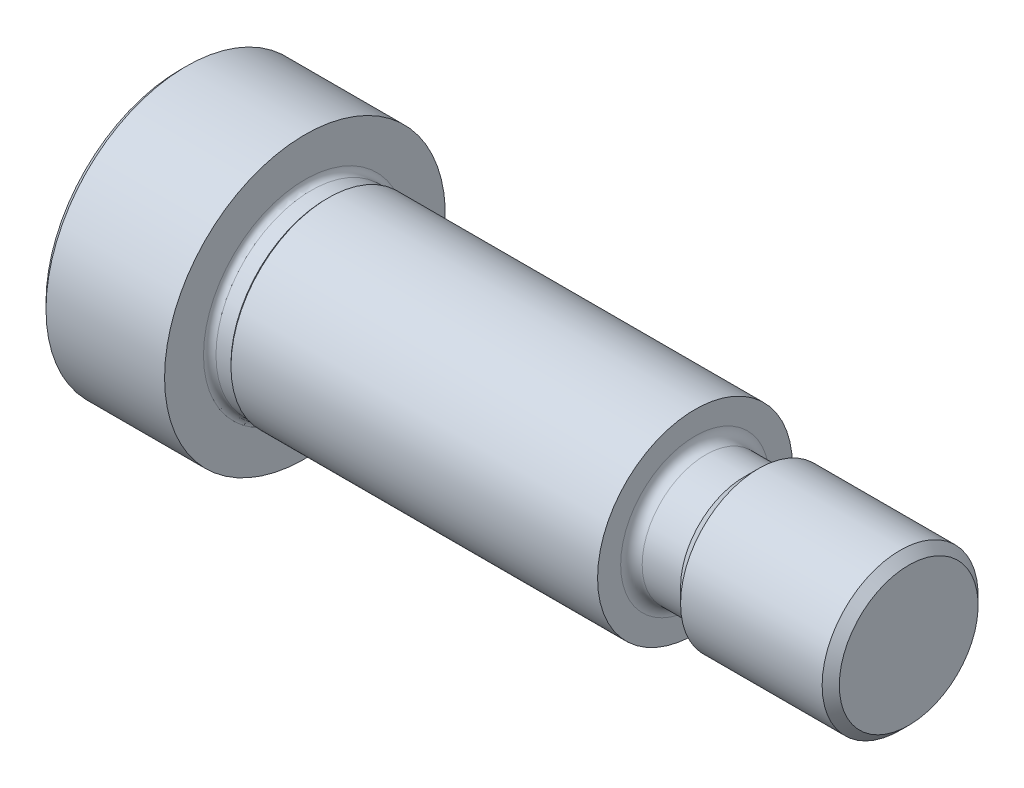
ISO-10303-21;
HEADER;
FILE_DESCRIPTION(('STEP AP214'),'2;1');
FILE_NAME('part.step','',(''),(''),'','','');
FILE_SCHEMA(('AUTOMOTIVE_DESIGN { 1 0 10303 214 1 1 1 1 }'));
ENDSEC;
DATA;
#1=APPLICATION_CONTEXT('core data for automotive mechanical design processes');
#2=APPLICATION_PROTOCOL_DEFINITION('international standard','automotive_design',2000,#1);
#3=PRODUCT_CONTEXT('',#1,'mechanical');
#4=PRODUCT('Part','Part','',(#3));
#5=PRODUCT_RELATED_PRODUCT_CATEGORY('part','',(#4));
#6=PRODUCT_DEFINITION_FORMATION('','',#4);
#7=PRODUCT_DEFINITION_CONTEXT('part definition',#1,'design');
#8=PRODUCT_DEFINITION('design','',#6,#7);
#9=PRODUCT_DEFINITION_SHAPE('','',#8);
#10=(LENGTH_UNIT() NAMED_UNIT(*) SI_UNIT(.MILLI.,.METRE.));
#11=(NAMED_UNIT(*) PLANE_ANGLE_UNIT() SI_UNIT($,.RADIAN.));
#12=(NAMED_UNIT(*) SI_UNIT($,.STERADIAN.) SOLID_ANGLE_UNIT());
#13=UNCERTAINTY_MEASURE_WITH_UNIT(LENGTH_MEASURE(1.E-05),#10,'distance_accuracy_value','');
#14=(GEOMETRIC_REPRESENTATION_CONTEXT(3) GLOBAL_UNCERTAINTY_ASSIGNED_CONTEXT((#13)) GLOBAL_UNIT_ASSIGNED_CONTEXT((#10,
#11,#12)) REPRESENTATION_CONTEXT('',''));
#15=CARTESIAN_POINT('',(0.,0.,0.));
#16=DIRECTION('',(0.,0.,1.));
#17=DIRECTION('',(1.,0.,0.));
#18=AXIS2_PLACEMENT_3D('',#15,#16,#17);
#19=CARTESIAN_POINT('',(0.,0.,0.));
#20=DIRECTION('',(-1.,0.,0.));
#21=DIRECTION('',(0.,0.,1.));
#22=AXIS2_PLACEMENT_3D('',#19,#20,#21);
#23=PLANE('',#22);
#24=CARTESIAN_POINT('',(0.,0.,0.));
#25=DIRECTION('',(-1.,0.,0.));
#26=DIRECTION('',(0.,0.,1.));
#27=AXIS2_PLACEMENT_3D('',#24,#25,#26);
#28=CIRCLE('',#27,17.2);
#29=CARTESIAN_POINT('',(0.,0.,17.2));
#30=VERTEX_POINT('',#29);
#31=EDGE_CURVE('E49',#30,#30,#28,.T.);
#32=ORIENTED_EDGE('',*,*,#31,.T.);
#33=EDGE_LOOP('',(#32));
#34=FACE_BOUND('',#33,.T.);
#35=DIRECTION('',(0.,-0.5,-0.866025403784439));
#36=VECTOR('',#35,1.);
#37=CARTESIAN_POINT('',(0.,-3.46410161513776,6.));
#38=LINE('',#37,#36);
#39=CARTESIAN_POINT('',(0.,-3.46410161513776,6.));
#40=VERTEX_POINT('',#39);
#41=CARTESIAN_POINT('',(0.,-6.92820323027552,0.));
#42=VERTEX_POINT('',#41);
#43=EDGE_CURVE('E56',#40,#42,#38,.T.);
#44=ORIENTED_EDGE('',*,*,#43,.T.);
#45=DIRECTION('',(0.,0.5,-0.866025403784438));
#46=VECTOR('',#45,1.);
#47=CARTESIAN_POINT('',(0.,-6.92820323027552,0.));
#48=LINE('',#47,#46);
#49=CARTESIAN_POINT('',(0.,-3.46410161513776,-6.));
#50=VERTEX_POINT('',#49);
#51=EDGE_CURVE('E331',#42,#50,#48,.T.);
#52=ORIENTED_EDGE('',*,*,#51,.T.);
#53=DIRECTION('',(0.,1.,0.));
#54=VECTOR('',#53,1.);
#55=CARTESIAN_POINT('',(0.,-3.46410161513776,-6.));
#56=LINE('',#55,#54);
#57=CARTESIAN_POINT('',(0.,3.46410161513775,-6.));
#58=VERTEX_POINT('',#57);
#59=EDGE_CURVE('E136',#50,#58,#56,.T.);
#60=ORIENTED_EDGE('',*,*,#59,.T.);
#61=DIRECTION('',(0.,0.500000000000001,0.866025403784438));
#62=VECTOR('',#61,1.);
#63=CARTESIAN_POINT('',(0.,3.46410161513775,-6.));
#64=LINE('',#63,#62);
#65=CARTESIAN_POINT('',(0.,6.92820323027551,0.));
#66=VERTEX_POINT('',#65);
#67=EDGE_CURVE('E334',#58,#66,#64,.T.);
#68=ORIENTED_EDGE('',*,*,#67,.T.);
#69=DIRECTION('',(0.,-0.500000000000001,0.866025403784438));
#70=VECTOR('',#69,1.);
#71=CARTESIAN_POINT('',(0.,6.92820323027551,0.));
#72=LINE('',#71,#70);
#73=CARTESIAN_POINT('',(0.,3.46410161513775,6.));
#74=VERTEX_POINT('',#73);
#75=EDGE_CURVE('E336',#66,#74,#72,.T.);
#76=ORIENTED_EDGE('',*,*,#75,.T.);
#77=DIRECTION('',(0.,-1.,0.));
#78=VECTOR('',#77,1.);
#79=CARTESIAN_POINT('',(0.,3.46410161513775,6.));
#80=LINE('',#79,#78);
#81=EDGE_CURVE('E338',#74,#40,#80,.T.);
#82=ORIENTED_EDGE('',*,*,#81,.T.);
#83=EDGE_LOOP('',(#44,#52,#60,#68,#76,#82));
#84=FACE_BOUND('',#83,.T.);
#85=ADVANCED_FACE('F41',(#34,#84),#23,.T.);
#86=CARTESIAN_POINT('',(-6.34999999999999,0.,0.));
#87=DIRECTION('',(-1.,0.,0.));
#88=DIRECTION('',(0.,0.,1.));
#89=AXIS2_PLACEMENT_3D('',#86,#87,#88);
#90=CYLINDRICAL_SURFACE('',#89,18.);
#91=CARTESIAN_POINT('',(0.800000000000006,0.,0.));
#92=DIRECTION('',(-1.,0.,0.));
#93=DIRECTION('',(0.,0.,1.));
#94=AXIS2_PLACEMENT_3D('',#91,#92,#93);
#95=CIRCLE('',#94,18.);
#96=CARTESIAN_POINT('',(0.800000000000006,0.,18.));
#97=VERTEX_POINT('',#96);
#98=EDGE_CURVE('E11',#97,#97,#95,.F.);
#99=ORIENTED_EDGE('',*,*,#98,.T.);
#100=EDGE_LOOP('',(#99));
#101=FACE_BOUND('',#100,.T.);
#102=CARTESIAN_POINT('',(16.,0.,0.));
#103=DIRECTION('',(-1.,0.,0.));
#104=DIRECTION('',(0.,0.,1.));
#105=AXIS2_PLACEMENT_3D('',#102,#103,#104);
#106=CIRCLE('',#105,18.);
#107=CARTESIAN_POINT('',(16.,0.,18.));
#108=VERTEX_POINT('',#107);
#109=EDGE_CURVE('E183',#108,#108,#106,.T.);
#110=ORIENTED_EDGE('',*,*,#109,.T.);
#111=EDGE_LOOP('',(#110));
#112=FACE_BOUND('',#111,.T.);
#113=ADVANCED_FACE('F203',(#101,#112),#90,.T.);
#114=CARTESIAN_POINT('',(16.,18.,0.));
#115=DIRECTION('',(1.,0.,0.));
#116=DIRECTION('',(0.,0.,-1.));
#117=AXIS2_PLACEMENT_3D('',#114,#115,#116);
#118=PLANE('',#117);
#119=CARTESIAN_POINT('',(16.,0.,0.));
#120=DIRECTION('',(-1.,0.,0.));
#121=DIRECTION('',(0.,0.,1.));
#122=AXIS2_PLACEMENT_3D('',#119,#120,#121);
#123=CIRCLE('',#122,13.01);
#124=CARTESIAN_POINT('',(16.,0.,13.01));
#125=VERTEX_POINT('',#124);
#126=EDGE_CURVE('E180',#125,#125,#123,.T.);
#127=ORIENTED_EDGE('',*,*,#126,.T.);
#128=EDGE_LOOP('',(#127));
#129=FACE_BOUND('',#128,.T.);
#130=ORIENTED_EDGE('',*,*,#109,.F.);
#131=EDGE_LOOP('',(#130));
#132=FACE_BOUND('',#131,.T.);
#133=ADVANCED_FACE('F206',(#129,#132),#118,.T.);
#134=CARTESIAN_POINT('',(16.8,0.,0.));
#135=DIRECTION('',(-1.,0.,0.));
#136=DIRECTION('',(0.,0.,1.));
#137=AXIS2_PLACEMENT_3D('',#134,#135,#136);
#138=TOROIDAL_SURFACE('',#137,13.01,0.800000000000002);
#139=ORIENTED_EDGE('',*,*,#126,.F.);
#140=EDGE_LOOP('',(#139));
#141=FACE_BOUND('',#140,.T.);
#142=CARTESIAN_POINT('',(16.8,0.,0.));
#143=DIRECTION('',(-1.,0.,0.));
#144=DIRECTION('',(0.,0.,1.));
#145=AXIS2_PLACEMENT_3D('',#142,#143,#144);
#146=CIRCLE('',#145,12.21);
#147=CARTESIAN_POINT('',(16.8,0.,12.21));
#148=VERTEX_POINT('',#147);
#149=EDGE_CURVE('E177',#148,#148,#146,.T.);
#150=ORIENTED_EDGE('',*,*,#149,.T.);
#151=EDGE_LOOP('',(#150));
#152=FACE_BOUND('',#151,.T.);
#153=ADVANCED_FACE('F212',(#141,#152),#138,.F.);
#154=CARTESIAN_POINT('',(-6.34999999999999,0.,0.));
#155=DIRECTION('',(-1.,0.,0.));
#156=DIRECTION('',(0.,0.,1.));
#157=AXIS2_PLACEMENT_3D('',#154,#155,#156);
#158=CYLINDRICAL_SURFACE('',#157,12.21);
#159=CARTESIAN_POINT('',(18.72,0.,0.));
#160=DIRECTION('',(-1.,0.,0.));
#161=DIRECTION('',(0.,0.,1.));
#162=AXIS2_PLACEMENT_3D('',#159,#160,#161);
#163=CIRCLE('',#162,12.21);
#164=CARTESIAN_POINT('',(18.72,0.,12.21));
#165=VERTEX_POINT('',#164);
#166=EDGE_CURVE('E174',#165,#165,#163,.T.);
#167=ORIENTED_EDGE('',*,*,#166,.T.);
#168=EDGE_LOOP('',(#167));
#169=FACE_BOUND('',#168,.T.);
#170=ORIENTED_EDGE('',*,*,#149,.F.);
#171=EDGE_LOOP('',(#170));
#172=FACE_BOUND('',#171,.T.);
#173=ADVANCED_FACE('F216',(#169,#172),#158,.T.);
#174=CARTESIAN_POINT('',(18.72,0.,0.));
#175=DIRECTION('',(1.,0.,0.));
#176=DIRECTION('',(0.,0.,-1.));
#177=AXIS2_PLACEMENT_3D('',#174,#175,#176);
#178=CONICAL_SURFACE('',#177,12.21,0.785398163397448);
#179=CARTESIAN_POINT('',(19.,0.,0.));
#180=DIRECTION('',(-1.,0.,0.));
#181=DIRECTION('',(0.,0.,1.));
#182=AXIS2_PLACEMENT_3D('',#179,#180,#181);
#183=CIRCLE('',#182,12.49);
#184=CARTESIAN_POINT('',(19.,0.,12.49));
#185=VERTEX_POINT('',#184);
#186=EDGE_CURVE('E171',#185,#185,#183,.T.);
#187=ORIENTED_EDGE('',*,*,#186,.T.);
#188=EDGE_LOOP('',(#187));
#189=FACE_BOUND('',#188,.T.);
#190=ORIENTED_EDGE('',*,*,#166,.F.);
#191=EDGE_LOOP('',(#190));
#192=FACE_BOUND('',#191,.T.);
#193=ADVANCED_FACE('F220',(#189,#192),#178,.T.);
#194=CARTESIAN_POINT('',(-6.34999999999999,0.,0.));
#195=DIRECTION('',(-1.,0.,0.));
#196=DIRECTION('',(0.,0.,1.));
#197=AXIS2_PLACEMENT_3D('',#194,#195,#196);
#198=CYLINDRICAL_SURFACE('',#197,12.49);
#199=CARTESIAN_POINT('',(66.,0.,0.));
#200=DIRECTION('',(-1.,0.,0.));
#201=DIRECTION('',(0.,0.,1.));
#202=AXIS2_PLACEMENT_3D('',#199,#200,#201);
#203=CIRCLE('',#202,12.49);
#204=CARTESIAN_POINT('',(66.,0.,12.49));
#205=VERTEX_POINT('',#204);
#206=EDGE_CURVE('E168',#205,#205,#203,.T.);
#207=ORIENTED_EDGE('',*,*,#206,.T.);
#208=EDGE_LOOP('',(#207));
#209=FACE_BOUND('',#208,.T.);
#210=ORIENTED_EDGE('',*,*,#186,.F.);
#211=EDGE_LOOP('',(#210));
#212=FACE_BOUND('',#211,.T.);
#213=ADVANCED_FACE('F224',(#209,#212),#198,.T.);
#214=CARTESIAN_POINT('',(66.,12.49,0.));
#215=DIRECTION('',(1.,0.,0.));
#216=DIRECTION('',(0.,0.,-1.));
#217=AXIS2_PLACEMENT_3D('',#214,#215,#216);
#218=PLANE('',#217);
#219=CARTESIAN_POINT('',(66.,0.,0.));
#220=DIRECTION('',(-1.,0.,0.));
#221=DIRECTION('',(0.,0.,1.));
#222=AXIS2_PLACEMENT_3D('',#219,#220,#221);
#223=CIRCLE('',#222,9.53);
#224=CARTESIAN_POINT('',(66.,0.,9.53));
#225=VERTEX_POINT('',#224);
#226=EDGE_CURVE('E165',#225,#225,#223,.T.);
#227=ORIENTED_EDGE('',*,*,#226,.T.);
#228=EDGE_LOOP('',(#227));
#229=FACE_BOUND('',#228,.T.);
#230=ORIENTED_EDGE('',*,*,#206,.F.);
#231=EDGE_LOOP('',(#230));
#232=FACE_BOUND('',#231,.T.);
#233=ADVANCED_FACE('F228',(#229,#232),#218,.T.);
#234=CARTESIAN_POINT('',(67.38,0.,0.));
#235=DIRECTION('',(-1.,0.,0.));
#236=DIRECTION('',(0.,0.,1.));
#237=AXIS2_PLACEMENT_3D('',#234,#235,#236);
#238=TOROIDAL_SURFACE('',#237,9.53,1.37999999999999);
#239=CARTESIAN_POINT('',(67.38,0.,0.));
#240=DIRECTION('',(-1.,0.,0.));
#241=DIRECTION('',(0.,0.,1.));
#242=AXIS2_PLACEMENT_3D('',#239,#240,#241);
#243=CIRCLE('',#242,8.15000000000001);
#244=CARTESIAN_POINT('',(67.38,0.,8.15000000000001));
#245=VERTEX_POINT('',#244);
#246=EDGE_CURVE('E162',#245,#245,#243,.T.);
#247=ORIENTED_EDGE('',*,*,#246,.T.);
#248=EDGE_LOOP('',(#247));
#249=FACE_BOUND('',#248,.T.);
#250=ORIENTED_EDGE('',*,*,#226,.F.);
#251=EDGE_LOOP('',(#250));
#252=FACE_BOUND('',#251,.T.);
#253=ADVANCED_FACE('F232',(#249,#252),#238,.F.);
#254=CARTESIAN_POINT('',(-6.34999999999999,0.,0.));
#255=DIRECTION('',(-1.,0.,0.));
#256=DIRECTION('',(0.,0.,1.));
#257=AXIS2_PLACEMENT_3D('',#254,#255,#256);
#258=CYLINDRICAL_SURFACE('',#257,8.15000000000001);
#259=CARTESIAN_POINT('',(72.3,0.,0.));
#260=DIRECTION('',(-1.,0.,0.));
#261=DIRECTION('',(0.,0.,1.));
#262=AXIS2_PLACEMENT_3D('',#259,#260,#261);
#263=CIRCLE('',#262,8.15);
#264=CARTESIAN_POINT('',(72.3,0.,8.15));
#265=VERTEX_POINT('',#264);
#266=EDGE_CURVE('E159',#265,#265,#263,.T.);
#267=ORIENTED_EDGE('',*,*,#266,.T.);
#268=EDGE_LOOP('',(#267));
#269=FACE_BOUND('',#268,.T.);
#270=ORIENTED_EDGE('',*,*,#246,.F.);
#271=EDGE_LOOP('',(#270));
#272=FACE_BOUND('',#271,.T.);
#273=ADVANCED_FACE('F236',(#269,#272),#258,.T.);
#274=CARTESIAN_POINT('',(72.3,0.,0.));
#275=DIRECTION('',(1.,0.,0.));
#276=DIRECTION('',(0.,0.,-1.));
#277=AXIS2_PLACEMENT_3D('',#274,#275,#276);
#278=CONICAL_SURFACE('',#277,8.15,0.785398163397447);
#279=CARTESIAN_POINT('',(74.15,0.,0.));
#280=DIRECTION('',(-1.,0.,0.));
#281=DIRECTION('',(0.,0.,1.));
#282=AXIS2_PLACEMENT_3D('',#279,#280,#281);
#283=CIRCLE('',#282,10.);
#284=CARTESIAN_POINT('',(74.15,0.,10.));
#285=VERTEX_POINT('',#284);
#286=EDGE_CURVE('E156',#285,#285,#283,.T.);
#287=ORIENTED_EDGE('',*,*,#286,.T.);
#288=EDGE_LOOP('',(#287));
#289=FACE_BOUND('',#288,.T.);
#290=ORIENTED_EDGE('',*,*,#266,.F.);
#291=EDGE_LOOP('',(#290));
#292=FACE_BOUND('',#291,.T.);
#293=ADVANCED_FACE('F240',(#289,#292),#278,.T.);
#294=CARTESIAN_POINT('',(-6.34999999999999,0.,0.));
#295=DIRECTION('',(-1.,0.,0.));
#296=DIRECTION('',(0.,0.,1.));
#297=AXIS2_PLACEMENT_3D('',#294,#295,#296);
#298=CYLINDRICAL_SURFACE('',#297,10.);
#299=CARTESIAN_POINT('',(92.2984999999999,0.,0.));
#300=DIRECTION('',(-1.,0.,0.));
#301=DIRECTION('',(0.,0.,1.));
#302=AXIS2_PLACEMENT_3D('',#299,#300,#301);
#303=CIRCLE('',#302,10.);
#304=CARTESIAN_POINT('',(92.2984999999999,0.,10.));
#305=VERTEX_POINT('',#304);
#306=EDGE_CURVE('E153',#305,#305,#303,.T.);
#307=ORIENTED_EDGE('',*,*,#306,.T.);
#308=EDGE_LOOP('',(#307));
#309=FACE_BOUND('',#308,.T.);
#310=ORIENTED_EDGE('',*,*,#286,.F.);
#311=EDGE_LOOP('',(#310));
#312=FACE_BOUND('',#311,.T.);
#313=ADVANCED_FACE('F244',(#309,#312),#298,.T.);
#314=CARTESIAN_POINT('',(92.2984999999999,0.,0.));
#315=DIRECTION('',(-1.,0.,0.));
#316=DIRECTION('',(0.,0.,1.));
#317=AXIS2_PLACEMENT_3D('',#314,#315,#316);
#318=CONICAL_SURFACE('',#317,10.,0.785398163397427);
#319=CARTESIAN_POINT('',(93.4,0.,0.));
#320=DIRECTION('',(-1.,0.,0.));
#321=DIRECTION('',(0.,0.,1.));
#322=AXIS2_PLACEMENT_3D('',#319,#320,#321);
#323=CIRCLE('',#322,8.8985);
#324=CARTESIAN_POINT('',(93.4,0.,8.8985));
#325=VERTEX_POINT('',#324);
#326=EDGE_CURVE('E149',#325,#325,#323,.T.);
#327=ORIENTED_EDGE('',*,*,#326,.T.);
#328=EDGE_LOOP('',(#327));
#329=FACE_BOUND('',#328,.T.);
#330=ORIENTED_EDGE('',*,*,#306,.F.);
#331=EDGE_LOOP('',(#330));
#332=FACE_BOUND('',#331,.T.);
#333=ADVANCED_FACE('F199',(#329,#332),#318,.T.);
#334=CARTESIAN_POINT('',(93.4,8.8985,0.));
#335=DIRECTION('',(1.,0.,0.));
#336=DIRECTION('',(0.,0.,-1.));
#337=AXIS2_PLACEMENT_3D('',#334,#335,#336);
#338=PLANE('',#337);
#339=ORIENTED_EDGE('',*,*,#326,.F.);
#340=EDGE_LOOP('',(#339));
#341=FACE_BOUND('',#340,.T.);
#342=ADVANCED_FACE('F190',(#341),#338,.T.);
#343=CARTESIAN_POINT('',(0.,0.,0.));
#344=DIRECTION('',(1.,0.,0.));
#345=DIRECTION('',(0.,0.,-1.));
#346=AXIS2_PLACEMENT_3D('',#343,#344,#345);
#347=CONICAL_SURFACE('',#346,17.2,0.785398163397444);
#348=ORIENTED_EDGE('',*,*,#98,.F.);
#349=EDGE_LOOP('',(#348));
#350=FACE_BOUND('',#349,.T.);
#351=ORIENTED_EDGE('',*,*,#31,.F.);
#352=EDGE_LOOP('',(#351));
#353=FACE_BOUND('',#352,.T.);
#354=ADVANCED_FACE('F43',(#350,#353),#347,.T.);
#355=CARTESIAN_POINT('',(10.,-6.92820323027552,0.));
#356=DIRECTION('',(0.,0.866025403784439,0.5));
#357=DIRECTION('',(0.,-0.5,0.866025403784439));
#358=AXIS2_PLACEMENT_3D('',#355,#356,#357);
#359=PLANE('',#358);
#360=DIRECTION('',(0.,0.5,-0.866025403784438));
#361=VECTOR('',#360,1.);
#362=CARTESIAN_POINT('',(10.,-6.92820323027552,0.));
#363=LINE('',#362,#361);
#364=CARTESIAN_POINT('',(10.,-6.92820323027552,0.));
#365=VERTEX_POINT('',#364);
#366=CARTESIAN_POINT('',(10.,-5.19615242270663,-3.));
#367=VERTEX_POINT('',#366);
#368=EDGE_CURVE('E64',#365,#367,#363,.T.);
#369=ORIENTED_EDGE('',*,*,#368,.T.);
#370=CARTESIAN_POINT('',(10.,-3.46410161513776,-6.));
#371=VERTEX_POINT('',#370);
#372=EDGE_CURVE('E114',#367,#371,#363,.T.);
#373=ORIENTED_EDGE('',*,*,#372,.T.);
#374=DIRECTION('',(-1.,0.,0.));
#375=VECTOR('',#374,1.);
#376=CARTESIAN_POINT('',(10.,-3.46410161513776,-6.));
#377=LINE('',#376,#375);
#378=EDGE_CURVE('E118',#371,#50,#377,.T.);
#379=ORIENTED_EDGE('',*,*,#378,.T.);
#380=ORIENTED_EDGE('',*,*,#51,.F.);
#381=DIRECTION('',(-1.,0.,0.));
#382=VECTOR('',#381,1.);
#383=CARTESIAN_POINT('',(10.,-6.92820323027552,0.));
#384=LINE('',#383,#382);
#385=EDGE_CURVE('E330',#365,#42,#384,.T.);
#386=ORIENTED_EDGE('',*,*,#385,.F.);
#387=EDGE_LOOP('',(#369,#373,#379,#380,#386));
#388=FACE_BOUND('',#387,.T.);
#389=ADVANCED_FACE('F116',(#388),#359,.T.);
#390=CARTESIAN_POINT('',(10.,-3.46410161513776,-6.));
#391=DIRECTION('',(0.,0.,1.));
#392=DIRECTION('',(0.,-1.,0.));
#393=AXIS2_PLACEMENT_3D('',#390,#391,#392);
#394=PLANE('',#393);
#395=DIRECTION('',(0.,1.,0.));
#396=VECTOR('',#395,1.);
#397=CARTESIAN_POINT('',(10.,-3.46410161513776,-6.));
#398=LINE('',#397,#396);
#399=CARTESIAN_POINT('',(10.,0.,-6.));
#400=VERTEX_POINT('',#399);
#401=EDGE_CURVE('E123',#371,#400,#398,.T.);
#402=ORIENTED_EDGE('',*,*,#401,.T.);
#403=CARTESIAN_POINT('',(10.,3.46410161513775,-6.));
#404=VERTEX_POINT('',#403);
#405=EDGE_CURVE('E131',#400,#404,#398,.T.);
#406=ORIENTED_EDGE('',*,*,#405,.T.);
#407=DIRECTION('',(-1.,0.,0.));
#408=VECTOR('',#407,1.);
#409=CARTESIAN_POINT('',(10.,3.46410161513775,-6.));
#410=LINE('',#409,#408);
#411=EDGE_CURVE('E138',#404,#58,#410,.T.);
#412=ORIENTED_EDGE('',*,*,#411,.T.);
#413=ORIENTED_EDGE('',*,*,#59,.F.);
#414=ORIENTED_EDGE('',*,*,#378,.F.);
#415=EDGE_LOOP('',(#402,#406,#412,#413,#414));
#416=FACE_BOUND('',#415,.T.);
#417=ADVANCED_FACE('F134',(#416),#394,.T.);
#418=CARTESIAN_POINT('',(10.,3.46410161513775,-6.));
#419=DIRECTION('',(0.,-0.866025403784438,0.500000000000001));
#420=DIRECTION('',(0.,-0.500000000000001,-0.866025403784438));
#421=AXIS2_PLACEMENT_3D('',#418,#419,#420);
#422=PLANE('',#421);
#423=DIRECTION('',(0.,0.500000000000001,0.866025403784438));
#424=VECTOR('',#423,1.);
#425=CARTESIAN_POINT('',(10.,3.46410161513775,-6.));
#426=LINE('',#425,#424);
#427=CARTESIAN_POINT('',(10.,5.19615242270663,-3.00000000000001));
#428=VERTEX_POINT('',#427);
#429=EDGE_CURVE('E294',#404,#428,#426,.T.);
#430=ORIENTED_EDGE('',*,*,#429,.T.);
#431=CARTESIAN_POINT('',(10.,6.92820323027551,0.));
#432=VERTEX_POINT('',#431);
#433=EDGE_CURVE('E130',#428,#432,#426,.T.);
#434=ORIENTED_EDGE('',*,*,#433,.T.);
#435=DIRECTION('',(-1.,0.,0.));
#436=VECTOR('',#435,1.);
#437=CARTESIAN_POINT('',(10.,6.92820323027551,0.));
#438=LINE('',#437,#436);
#439=EDGE_CURVE('E144',#432,#66,#438,.T.);
#440=ORIENTED_EDGE('',*,*,#439,.T.);
#441=ORIENTED_EDGE('',*,*,#67,.F.);
#442=ORIENTED_EDGE('',*,*,#411,.F.);
#443=EDGE_LOOP('',(#430,#434,#440,#441,#442));
#444=FACE_BOUND('',#443,.T.);
#445=ADVANCED_FACE('F258',(#444),#422,.T.);
#446=CARTESIAN_POINT('',(10.,6.92820323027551,0.));
#447=DIRECTION('',(0.,-0.866025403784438,-0.500000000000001));
#448=DIRECTION('',(0.,0.500000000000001,-0.866025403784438));
#449=AXIS2_PLACEMENT_3D('',#446,#447,#448);
#450=PLANE('',#449);
#451=DIRECTION('',(0.,-0.500000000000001,0.866025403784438));
#452=VECTOR('',#451,1.);
#453=CARTESIAN_POINT('',(10.,6.92820323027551,0.));
#454=LINE('',#453,#452);
#455=CARTESIAN_POINT('',(10.,5.19615242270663,3.00000000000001));
#456=VERTEX_POINT('',#455);
#457=EDGE_CURVE('E299',#432,#456,#454,.T.);
#458=ORIENTED_EDGE('',*,*,#457,.T.);
#459=CARTESIAN_POINT('',(10.,3.46410161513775,6.));
#460=VERTEX_POINT('',#459);
#461=EDGE_CURVE('E305',#456,#460,#454,.T.);
#462=ORIENTED_EDGE('',*,*,#461,.T.);
#463=DIRECTION('',(-1.,0.,0.));
#464=VECTOR('',#463,1.);
#465=CARTESIAN_POINT('',(10.,3.46410161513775,6.));
#466=LINE('',#465,#464);
#467=EDGE_CURVE('E325',#460,#74,#466,.T.);
#468=ORIENTED_EDGE('',*,*,#467,.T.);
#469=ORIENTED_EDGE('',*,*,#75,.F.);
#470=ORIENTED_EDGE('',*,*,#439,.F.);
#471=EDGE_LOOP('',(#458,#462,#468,#469,#470));
#472=FACE_BOUND('',#471,.T.);
#473=ADVANCED_FACE('F261',(#472),#450,.T.);
#474=CARTESIAN_POINT('',(10.,3.46410161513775,6.));
#475=DIRECTION('',(0.,0.,-1.));
#476=DIRECTION('',(-1.,0.,0.));
#477=AXIS2_PLACEMENT_3D('',#474,#475,#476);
#478=PLANE('',#477);
#479=DIRECTION('',(0.,-1.,0.));
#480=VECTOR('',#479,1.);
#481=CARTESIAN_POINT('',(10.,3.46410161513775,6.));
#482=LINE('',#481,#480);
#483=CARTESIAN_POINT('',(10.,0.,6.));
#484=VERTEX_POINT('',#483);
#485=EDGE_CURVE('E312',#460,#484,#482,.T.);
#486=ORIENTED_EDGE('',*,*,#485,.T.);
#487=CARTESIAN_POINT('',(10.,-3.46410161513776,6.));
#488=VERTEX_POINT('',#487);
#489=EDGE_CURVE('E315',#484,#488,#482,.T.);
#490=ORIENTED_EDGE('',*,*,#489,.T.);
#491=DIRECTION('',(-1.,0.,0.));
#492=VECTOR('',#491,1.);
#493=CARTESIAN_POINT('',(10.,-3.46410161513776,6.));
#494=LINE('',#493,#492);
#495=EDGE_CURVE('E343',#488,#40,#494,.T.);
#496=ORIENTED_EDGE('',*,*,#495,.T.);
#497=ORIENTED_EDGE('',*,*,#81,.F.);
#498=ORIENTED_EDGE('',*,*,#467,.F.);
#499=EDGE_LOOP('',(#486,#490,#496,#497,#498));
#500=FACE_BOUND('',#499,.T.);
#501=ADVANCED_FACE('F265',(#500),#478,.T.);
#502=CARTESIAN_POINT('',(10.,-3.46410161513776,6.));
#503=DIRECTION('',(0.,0.866025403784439,-0.5));
#504=DIRECTION('',(0.,0.5,0.866025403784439));
#505=AXIS2_PLACEMENT_3D('',#502,#503,#504);
#506=PLANE('',#505);
#507=DIRECTION('',(0.,-0.5,-0.866025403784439));
#508=VECTOR('',#507,1.);
#509=CARTESIAN_POINT('',(10.,-3.46410161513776,6.));
#510=LINE('',#509,#508);
#511=CARTESIAN_POINT('',(10.,-5.19615242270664,3.));
#512=VERTEX_POINT('',#511);
#513=EDGE_CURVE('E318',#488,#512,#510,.T.);
#514=ORIENTED_EDGE('',*,*,#513,.T.);
#515=EDGE_CURVE('E326',#512,#365,#510,.T.);
#516=ORIENTED_EDGE('',*,*,#515,.T.);
#517=ORIENTED_EDGE('',*,*,#385,.T.);
#518=ORIENTED_EDGE('',*,*,#43,.F.);
#519=ORIENTED_EDGE('',*,*,#495,.F.);
#520=EDGE_LOOP('',(#514,#516,#517,#518,#519));
#521=FACE_BOUND('',#520,.T.);
#522=ADVANCED_FACE('F269',(#521),#506,.T.);
#523=CARTESIAN_POINT('',(10.,0.,-12.));
#524=DIRECTION('',(1.,0.,0.));
#525=DIRECTION('',(0.,0.,-1.));
#526=AXIS2_PLACEMENT_3D('',#523,#524,#525);
#527=PLANE('',#526);
#528=CARTESIAN_POINT('',(10.,0.,0.));
#529=DIRECTION('',(-1.,0.,0.));
#530=DIRECTION('',(0.,0.,1.));
#531=AXIS2_PLACEMENT_3D('',#528,#529,#530);
#532=CIRCLE('',#531,6.);
#533=EDGE_CURVE('E291',#428,#400,#532,.T.);
#534=ORIENTED_EDGE('',*,*,#533,.F.);
#535=ORIENTED_EDGE('',*,*,#429,.F.);
#536=ORIENTED_EDGE('',*,*,#405,.F.);
#537=EDGE_LOOP('',(#534,#535,#536));
#538=FACE_BOUND('',#537,.T.);
#539=ADVANCED_FACE('F273',(#538),#527,.F.);
#540=EDGE_CURVE('E150',#456,#428,#532,.T.);
#541=ORIENTED_EDGE('',*,*,#540,.F.);
#542=ORIENTED_EDGE('',*,*,#457,.F.);
#543=ORIENTED_EDGE('',*,*,#433,.F.);
#544=EDGE_LOOP('',(#541,#542,#543));
#545=FACE_BOUND('',#544,.T.);
#546=ADVANCED_FACE('F283',(#545),#527,.F.);
#547=EDGE_CURVE('E143',#484,#456,#532,.T.);
#548=ORIENTED_EDGE('',*,*,#547,.F.);
#549=ORIENTED_EDGE('',*,*,#485,.F.);
#550=ORIENTED_EDGE('',*,*,#461,.F.);
#551=EDGE_LOOP('',(#548,#549,#550));
#552=FACE_BOUND('',#551,.T.);
#553=ADVANCED_FACE('F288',(#552),#527,.F.);
#554=EDGE_CURVE('E137',#512,#484,#532,.T.);
#555=ORIENTED_EDGE('',*,*,#554,.F.);
#556=ORIENTED_EDGE('',*,*,#513,.F.);
#557=ORIENTED_EDGE('',*,*,#489,.F.);
#558=EDGE_LOOP('',(#555,#556,#557));
#559=FACE_BOUND('',#558,.T.);
#560=ADVANCED_FACE('F280',(#559),#527,.F.);
#561=EDGE_CURVE('E141',#367,#512,#532,.T.);
#562=ORIENTED_EDGE('',*,*,#561,.F.);
#563=ORIENTED_EDGE('',*,*,#368,.F.);
#564=ORIENTED_EDGE('',*,*,#515,.F.);
#565=EDGE_LOOP('',(#562,#563,#564));
#566=FACE_BOUND('',#565,.T.);
#567=ADVANCED_FACE('F276',(#566),#527,.F.);
#568=EDGE_CURVE('E126',#400,#367,#532,.T.);
#569=ORIENTED_EDGE('',*,*,#568,.F.);
#570=ORIENTED_EDGE('',*,*,#401,.F.);
#571=ORIENTED_EDGE('',*,*,#372,.F.);
#572=EDGE_LOOP('',(#569,#570,#571));
#573=FACE_BOUND('',#572,.T.);
#574=ADVANCED_FACE('F124',(#573),#527,.F.);
#575=CARTESIAN_POINT('',(13.4641016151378,0.,0.));
#576=DIRECTION('',(-1.,0.,0.));
#577=DIRECTION('',(0.,0.,1.));
#578=AXIS2_PLACEMENT_3D('',#575,#576,#577);
#579=CONICAL_SURFACE('',#578,0.,1.04719755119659);
#580=ORIENTED_EDGE('',*,*,#547,.T.);
#581=ORIENTED_EDGE('',*,*,#540,.T.);
#582=ORIENTED_EDGE('',*,*,#533,.T.);
#583=ORIENTED_EDGE('',*,*,#568,.T.);
#584=ORIENTED_EDGE('',*,*,#561,.T.);
#585=ORIENTED_EDGE('',*,*,#554,.T.);
#586=EDGE_LOOP('',(#580,#581,#582,#583,#584,#585));
#587=FACE_BOUND('',#586,.T.);
#588=CARTESIAN_POINT('',(13.4641016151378,0.,0.));
#589=VERTEX_POINT('',#588);
#590=VERTEX_LOOP('',#589);
#591=FACE_BOUND('',#590,.T.);
#592=ADVANCED_FACE('F252',(#587,#591),#579,.F.);
#593=CLOSED_SHELL('',(#85,#113,#133,#153,#173,#193,#213,#233,#253,#273,#293,#313,#333,#342,#354,
#389,#417,#445,#473,#501,#522,#539,#546,#553,#560,#567,#574,#592));
#594=MANIFOLD_SOLID_BREP('B2',#593);
#595=ADVANCED_BREP_SHAPE_REPRESENTATION('',(#18,#594),#14);
#596=SHAPE_DEFINITION_REPRESENTATION(#9,#595);
ENDSEC;
END-ISO-10303-21;
